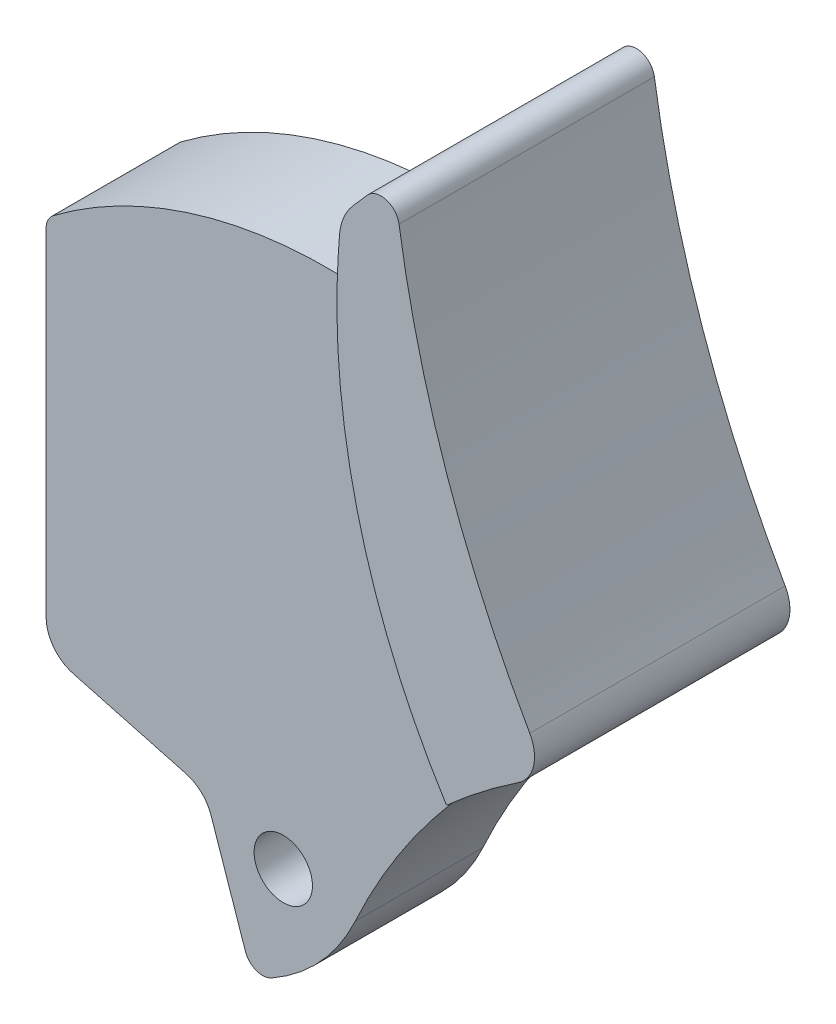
ISO-10303-21;
HEADER;
FILE_DESCRIPTION(('STEP AP214'),'2;1');
FILE_NAME('part.step','',(''),(''),'','','');
FILE_SCHEMA(('AUTOMOTIVE_DESIGN { 1 0 10303 214 1 1 1 1 }'));
ENDSEC;
DATA;
#1=APPLICATION_CONTEXT('core data for automotive mechanical design processes');
#2=APPLICATION_PROTOCOL_DEFINITION('international standard','automotive_design',2000,#1);
#3=PRODUCT_CONTEXT('',#1,'mechanical');
#4=PRODUCT('Part','Part','',(#3));
#5=PRODUCT_RELATED_PRODUCT_CATEGORY('part','',(#4));
#6=PRODUCT_DEFINITION_FORMATION('','',#4);
#7=PRODUCT_DEFINITION_CONTEXT('part definition',#1,'design');
#8=PRODUCT_DEFINITION('design','',#6,#7);
#9=PRODUCT_DEFINITION_SHAPE('','',#8);
#10=(LENGTH_UNIT() NAMED_UNIT(*) SI_UNIT(.MILLI.,.METRE.));
#11=(NAMED_UNIT(*) PLANE_ANGLE_UNIT() SI_UNIT($,.RADIAN.));
#12=(NAMED_UNIT(*) SI_UNIT($,.STERADIAN.) SOLID_ANGLE_UNIT());
#13=UNCERTAINTY_MEASURE_WITH_UNIT(LENGTH_MEASURE(1.E-05),#10,'distance_accuracy_value','');
#14=(GEOMETRIC_REPRESENTATION_CONTEXT(3) GLOBAL_UNCERTAINTY_ASSIGNED_CONTEXT((#13)) GLOBAL_UNIT_ASSIGNED_CONTEXT((#10,
#11,#12)) REPRESENTATION_CONTEXT('',''));
#15=CARTESIAN_POINT('',(0.,0.,0.));
#16=DIRECTION('',(0.,0.,1.));
#17=DIRECTION('',(1.,0.,0.));
#18=AXIS2_PLACEMENT_3D('',#15,#16,#17);
#19=CARTESIAN_POINT('',(14.3895907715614,1.74499070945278,14.));
#20=DIRECTION('',(0.,0.,-1.));
#21=DIRECTION('',(-1.,0.,0.));
#22=AXIS2_PLACEMENT_3D('',#19,#20,#21);
#23=CYLINDRICAL_SURFACE('',#22,25.);
#24=DIRECTION('',(0.,0.,-1.));
#25=VECTOR('',#24,1.);
#26=CARTESIAN_POINT('',(16.2535987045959,26.6754033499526,14.));
#27=LINE('',#26,#25);
#28=CARTESIAN_POINT('',(16.2535987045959,26.6754033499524,10.5));
#29=VERTEX_POINT('',#28);
#30=CARTESIAN_POINT('',(16.2535987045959,26.6754033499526,3.5));
#31=VERTEX_POINT('',#30);
#32=EDGE_CURVE('E547',#29,#31,#27,.T.);
#33=ORIENTED_EDGE('',*,*,#32,.T.);
#34=CARTESIAN_POINT('',(14.3895907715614,1.74499070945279,3.50000000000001));
#35=DIRECTION('',(0.,0.,1.));
#36=DIRECTION('',(1.,0.,0.));
#37=AXIS2_PLACEMENT_3D('',#34,#35,#36);
#38=CIRCLE('',#37,25.);
#39=CARTESIAN_POINT('',(-0.645696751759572,21.7184763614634,3.5));
#40=VERTEX_POINT('',#39);
#41=EDGE_CURVE('E654',#31,#40,#38,.T.);
#42=ORIENTED_EDGE('',*,*,#41,.T.);
#43=DIRECTION('',(0.,0.,-1.));
#44=VECTOR('',#43,1.);
#45=CARTESIAN_POINT('',(-0.645696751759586,21.7184763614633,14.));
#46=LINE('',#45,#44);
#47=CARTESIAN_POINT('',(-0.645696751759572,21.7184763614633,10.5));
#48=VERTEX_POINT('',#47);
#49=EDGE_CURVE('E544',#48,#40,#46,.T.);
#50=ORIENTED_EDGE('',*,*,#49,.F.);
#51=CARTESIAN_POINT('',(14.3895907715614,1.74499070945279,10.5));
#52=DIRECTION('',(0.,0.,1.));
#53=DIRECTION('',(1.,0.,0.));
#54=AXIS2_PLACEMENT_3D('',#51,#52,#53);
#55=CIRCLE('',#54,25.);
#56=EDGE_CURVE('E622',#29,#48,#55,.T.);
#57=ORIENTED_EDGE('',*,*,#56,.F.);
#58=EDGE_LOOP('',(#33,#42,#50,#57));
#59=FACE_BOUND('',#58,.T.);
#60=ADVANCED_FACE('F350',(#59),#23,.T.);
#61=CARTESIAN_POINT('',(-0.0442852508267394,20.9195369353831,14.));
#62=DIRECTION('',(0.,0.,-1.));
#63=DIRECTION('',(-1.,0.,0.));
#64=AXIS2_PLACEMENT_3D('',#61,#62,#63);
#65=CYLINDRICAL_SURFACE('',#64,1.);
#66=ORIENTED_EDGE('',*,*,#49,.T.);
#67=CARTESIAN_POINT('',(-0.0442852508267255,20.919536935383,3.5));
#68=DIRECTION('',(0.,0.,1.));
#69=DIRECTION('',(1.,0.,0.));
#70=AXIS2_PLACEMENT_3D('',#67,#68,#69);
#71=CIRCLE('',#70,1.);
#72=CARTESIAN_POINT('',(-1.04428525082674,20.9195369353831,3.49999999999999));
#73=VERTEX_POINT('',#72);
#74=EDGE_CURVE('E657',#40,#73,#71,.T.);
#75=ORIENTED_EDGE('',*,*,#74,.T.);
#76=DIRECTION('',(0.,0.,-1.));
#77=VECTOR('',#76,1.);
#78=CARTESIAN_POINT('',(-1.04428525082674,20.9195369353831,14.));
#79=LINE('',#78,#77);
#80=CARTESIAN_POINT('',(-1.04428525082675,20.9195369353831,10.5));
#81=VERTEX_POINT('',#80);
#82=EDGE_CURVE('E541',#81,#73,#79,.T.);
#83=ORIENTED_EDGE('',*,*,#82,.F.);
#84=CARTESIAN_POINT('',(-0.0442852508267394,20.919536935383,10.5));
#85=DIRECTION('',(0.,0.,1.));
#86=DIRECTION('',(1.,0.,0.));
#87=AXIS2_PLACEMENT_3D('',#84,#85,#86);
#88=CIRCLE('',#87,1.);
#89=EDGE_CURVE('E627',#48,#81,#88,.T.);
#90=ORIENTED_EDGE('',*,*,#89,.F.);
#91=EDGE_LOOP('',(#66,#75,#83,#90));
#92=FACE_BOUND('',#91,.T.);
#93=ADVANCED_FACE('F699',(#92),#65,.T.);
#94=CARTESIAN_POINT('',(-1.04428525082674,2.4467611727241,14.));
#95=DIRECTION('',(1.,0.,0.));
#96=DIRECTION('',(0.,1.,0.));
#97=AXIS2_PLACEMENT_3D('',#94,#95,#96);
#98=PLANE('',#97);
#99=ORIENTED_EDGE('',*,*,#82,.T.);
#100=DIRECTION('',(0.,-1.,0.));
#101=VECTOR('',#100,1.);
#102=CARTESIAN_POINT('',(-1.04428525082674,2.44676117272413,3.50000000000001));
#103=LINE('',#102,#101);
#104=CARTESIAN_POINT('',(-1.04428525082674,2.44676117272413,3.50000000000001));
#105=VERTEX_POINT('',#104);
#106=EDGE_CURVE('E660',#73,#105,#103,.T.);
#107=ORIENTED_EDGE('',*,*,#106,.T.);
#108=DIRECTION('',(0.,0.,-1.));
#109=VECTOR('',#108,1.);
#110=CARTESIAN_POINT('',(-1.04428525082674,2.4467611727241,14.));
#111=LINE('',#110,#109);
#112=CARTESIAN_POINT('',(-1.04428525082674,2.4467611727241,10.5));
#113=VERTEX_POINT('',#112);
#114=EDGE_CURVE('E538',#113,#105,#111,.T.);
#115=ORIENTED_EDGE('',*,*,#114,.F.);
#116=DIRECTION('',(0.,-1.,0.));
#117=VECTOR('',#116,1.);
#118=CARTESIAN_POINT('',(-1.04428525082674,2.4467611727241,10.5));
#119=LINE('',#118,#117);
#120=EDGE_CURVE('E629',#81,#113,#119,.T.);
#121=ORIENTED_EDGE('',*,*,#120,.F.);
#122=EDGE_LOOP('',(#99,#107,#115,#121));
#123=FACE_BOUND('',#122,.T.);
#124=ADVANCED_FACE('F706',(#123),#98,.F.);
#125=CARTESIAN_POINT('',(0.955714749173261,2.44676117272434,14.));
#126=DIRECTION('',(0.,0.,-1.));
#127=DIRECTION('',(-1.,0.,0.));
#128=AXIS2_PLACEMENT_3D('',#125,#126,#127);
#129=CYLINDRICAL_SURFACE('',#128,2.);
#130=ORIENTED_EDGE('',*,*,#114,.T.);
#131=CARTESIAN_POINT('',(0.955714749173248,2.44676117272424,3.5));
#132=DIRECTION('',(0.,0.,1.));
#133=DIRECTION('',(1.,0.,0.));
#134=AXIS2_PLACEMENT_3D('',#131,#132,#133);
#135=CIRCLE('',#134,2.);
#136=CARTESIAN_POINT('',(0.438076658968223,0.514909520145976,3.5));
#137=VERTEX_POINT('',#136);
#138=EDGE_CURVE('E663',#105,#137,#135,.T.);
#139=ORIENTED_EDGE('',*,*,#138,.T.);
#140=DIRECTION('',(0.,0.,-1.));
#141=VECTOR('',#140,1.);
#142=CARTESIAN_POINT('',(0.438076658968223,0.514909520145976,14.));
#143=LINE('',#142,#141);
#144=CARTESIAN_POINT('',(0.438076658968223,0.514909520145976,10.5));
#145=VERTEX_POINT('',#144);
#146=EDGE_CURVE('E535',#145,#137,#143,.T.);
#147=ORIENTED_EDGE('',*,*,#146,.F.);
#148=CARTESIAN_POINT('',(0.955714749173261,2.44676117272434,10.5));
#149=DIRECTION('',(0.,0.,1.));
#150=DIRECTION('',(1.,0.,0.));
#151=AXIS2_PLACEMENT_3D('',#148,#149,#150);
#152=CIRCLE('',#151,2.);
#153=EDGE_CURVE('E633',#113,#145,#152,.T.);
#154=ORIENTED_EDGE('',*,*,#153,.F.);
#155=EDGE_LOOP('',(#130,#139,#147,#154));
#156=FACE_BOUND('',#155,.T.);
#157=ADVANCED_FACE('F741',(#156),#129,.T.);
#158=CARTESIAN_POINT('',(0.438076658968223,0.514909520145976,14.));
#159=DIRECTION('',(0.258819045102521,0.96592582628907,0.));
#160=DIRECTION('',(-0.96592582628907,0.258819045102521,0.));
#161=AXIS2_PLACEMENT_3D('',#158,#159,#160);
#162=PLANE('',#161);
#163=ORIENTED_EDGE('',*,*,#146,.T.);
#164=DIRECTION('',(0.96592582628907,-0.258819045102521,0.));
#165=VECTOR('',#164,1.);
#166=CARTESIAN_POINT('',(0.438076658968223,0.514909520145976,3.5));
#167=LINE('',#166,#165);
#168=CARTESIAN_POINT('',(6.61894554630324,-1.14124930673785,3.5));
#169=VERTEX_POINT('',#168);
#170=EDGE_CURVE('E666',#137,#169,#167,.T.);
#171=ORIENTED_EDGE('',*,*,#170,.T.);
#172=DIRECTION('',(0.,0.,-1.));
#173=VECTOR('',#172,1.);
#174=CARTESIAN_POINT('',(6.61894554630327,-1.1412493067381,14.));
#175=LINE('',#174,#173);
#176=CARTESIAN_POINT('',(6.61894554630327,-1.14124930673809,10.5));
#177=VERTEX_POINT('',#176);
#178=EDGE_CURVE('E532',#177,#169,#175,.T.);
#179=ORIENTED_EDGE('',*,*,#178,.F.);
#180=DIRECTION('',(0.96592582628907,-0.258819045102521,0.));
#181=VECTOR('',#180,1.);
#182=CARTESIAN_POINT('',(0.438076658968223,0.514909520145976,10.5));
#183=LINE('',#182,#181);
#184=EDGE_CURVE('E635',#145,#177,#183,.T.);
#185=ORIENTED_EDGE('',*,*,#184,.F.);
#186=EDGE_LOOP('',(#163,#171,#179,#185));
#187=FACE_BOUND('',#186,.T.);
#188=ADVANCED_FACE('F747',(#187),#162,.F.);
#189=CARTESIAN_POINT('',(6.10130745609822,-3.07310095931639,14.));
#190=DIRECTION('',(0.,0.,-1.));
#191=DIRECTION('',(-1.,0.,0.));
#192=AXIS2_PLACEMENT_3D('',#189,#190,#191);
#193=CYLINDRICAL_SURFACE('',#192,2.);
#194=ORIENTED_EDGE('',*,*,#178,.T.);
#195=CARTESIAN_POINT('',(6.1013074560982,-3.07310095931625,3.50000000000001));
#196=DIRECTION('',(0.,0.,1.));
#197=DIRECTION('',(1.,0.,0.));
#198=AXIS2_PLACEMENT_3D('',#195,#196,#197);
#199=CIRCLE('',#198,2.);
#200=CARTESIAN_POINT('',(7.9938718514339,-2.42641710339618,3.5));
#201=VERTEX_POINT('',#200);
#202=EDGE_CURVE('E669',#169,#201,#199,.F.);
#203=ORIENTED_EDGE('',*,*,#202,.T.);
#204=DIRECTION('',(0.,0.,-1.));
#205=VECTOR('',#204,1.);
#206=CARTESIAN_POINT('',(7.9938718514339,-2.42641710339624,14.));
#207=LINE('',#206,#205);
#208=CARTESIAN_POINT('',(7.9938718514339,-2.42641710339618,10.5));
#209=VERTEX_POINT('',#208);
#210=EDGE_CURVE('E529',#209,#201,#207,.T.);
#211=ORIENTED_EDGE('',*,*,#210,.F.);
#212=CARTESIAN_POINT('',(6.10130745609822,-3.0731009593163,10.5));
#213=DIRECTION('',(0.,0.,1.));
#214=DIRECTION('',(1.,0.,0.));
#215=AXIS2_PLACEMENT_3D('',#212,#213,#214);
#216=CIRCLE('',#215,2.);
#217=EDGE_CURVE('E637',#177,#209,#216,.F.);
#218=ORIENTED_EDGE('',*,*,#217,.F.);
#219=EDGE_LOOP('',(#194,#203,#211,#218));
#220=FACE_BOUND('',#219,.T.);
#221=ADVANCED_FACE('F749',(#220),#193,.F.);
#222=CARTESIAN_POINT('',(7.9938718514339,-2.42641710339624,14.));
#223=DIRECTION('',(0.946282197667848,0.323341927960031,0.));
#224=DIRECTION('',(-0.323341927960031,0.946282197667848,0.));
#225=AXIS2_PLACEMENT_3D('',#222,#223,#224);
#226=PLANE('',#225);
#227=ORIENTED_EDGE('',*,*,#210,.T.);
#228=DIRECTION('',(0.323341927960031,-0.946282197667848,0.));
#229=VECTOR('',#228,1.);
#230=CARTESIAN_POINT('',(7.9938718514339,-2.42641710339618,3.5));
#231=LINE('',#230,#229);
#232=CARTESIAN_POINT('',(9.88088302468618,-7.94888395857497,3.5));
#233=VERTEX_POINT('',#232);
#234=EDGE_CURVE('E672',#201,#233,#231,.T.);
#235=ORIENTED_EDGE('',*,*,#234,.T.);
#236=DIRECTION('',(0.,0.,-1.));
#237=VECTOR('',#236,1.);
#238=CARTESIAN_POINT('',(9.88088302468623,-7.94888395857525,14.));
#239=LINE('',#238,#237);
#240=CARTESIAN_POINT('',(9.88088302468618,-7.94888395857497,10.5));
#241=VERTEX_POINT('',#240);
#242=EDGE_CURVE('E520',#241,#233,#239,.T.);
#243=ORIENTED_EDGE('',*,*,#242,.F.);
#244=DIRECTION('',(0.323341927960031,-0.946282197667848,0.));
#245=VECTOR('',#244,1.);
#246=CARTESIAN_POINT('',(7.9938718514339,-2.42641710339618,10.5));
#247=LINE('',#246,#245);
#248=EDGE_CURVE('E639',#209,#241,#247,.T.);
#249=ORIENTED_EDGE('',*,*,#248,.F.);
#250=EDGE_LOOP('',(#227,#235,#243,#249));
#251=FACE_BOUND('',#250,.T.);
#252=ADVANCED_FACE('F755',(#251),#226,.F.);
#253=CARTESIAN_POINT('',(10.827165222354,-7.62554203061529,14.));
#254=DIRECTION('',(0.,0.,-1.));
#255=DIRECTION('',(-1.,0.,0.));
#256=AXIS2_PLACEMENT_3D('',#253,#254,#255);
#257=CYLINDRICAL_SURFACE('',#256,1.);
#258=ORIENTED_EDGE('',*,*,#242,.T.);
#259=CARTESIAN_POINT('',(10.8271652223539,-7.62554203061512,3.5));
#260=DIRECTION('',(0.,0.,1.));
#261=DIRECTION('',(1.,0.,0.));
#262=AXIS2_PLACEMENT_3D('',#259,#260,#261);
#263=CIRCLE('',#262,1.);
#264=CARTESIAN_POINT('',(11.3196646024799,-8.4958548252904,3.5));
#265=VERTEX_POINT('',#264);
#266=EDGE_CURVE('E675',#233,#265,#263,.T.);
#267=ORIENTED_EDGE('',*,*,#266,.T.);
#268=DIRECTION('',(0.,0.,-1.));
#269=VECTOR('',#268,1.);
#270=CARTESIAN_POINT('',(11.3196646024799,-8.49585482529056,14.));
#271=LINE('',#270,#269);
#272=CARTESIAN_POINT('',(11.3196646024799,-8.49585482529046,10.5));
#273=VERTEX_POINT('',#272);
#274=EDGE_CURVE('E516',#273,#265,#271,.T.);
#275=ORIENTED_EDGE('',*,*,#274,.F.);
#276=CARTESIAN_POINT('',(10.8271652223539,-7.6255420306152,10.5));
#277=DIRECTION('',(0.,0.,1.));
#278=DIRECTION('',(1.,0.,0.));
#279=AXIS2_PLACEMENT_3D('',#276,#277,#278);
#280=CIRCLE('',#279,1.);
#281=EDGE_CURVE('E641',#241,#273,#280,.T.);
#282=ORIENTED_EDGE('',*,*,#281,.F.);
#283=EDGE_LOOP('',(#258,#267,#275,#282));
#284=FACE_BOUND('',#283,.T.);
#285=ADVANCED_FACE('F757',(#284),#257,.T.);
#286=CARTESIAN_POINT('',(5.902171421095,1.07758591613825,14.));
#287=DIRECTION('',(0.,0.,-1.));
#288=DIRECTION('',(-1.,0.,0.));
#289=AXIS2_PLACEMENT_3D('',#286,#287,#288);
#290=CYLINDRICAL_SURFACE('',#289,11.);
#291=ORIENTED_EDGE('',*,*,#274,.T.);
#292=CARTESIAN_POINT('',(5.902171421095,1.07758591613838,3.5));
#293=DIRECTION('',(0.,0.,1.));
#294=DIRECTION('',(1.,0.,0.));
#295=AXIS2_PLACEMENT_3D('',#292,#293,#294);
#296=CIRCLE('',#295,11.);
#297=CARTESIAN_POINT('',(15.8992918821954,-3.51126824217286,3.5));
#298=VERTEX_POINT('',#297);
#299=EDGE_CURVE('E678',#265,#298,#296,.T.);
#300=ORIENTED_EDGE('',*,*,#299,.T.);
#301=DIRECTION('',(0.,0.,-1.));
#302=VECTOR('',#301,1.);
#303=CARTESIAN_POINT('',(15.8992918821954,-3.51126824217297,14.));
#304=LINE('',#303,#302);
#305=CARTESIAN_POINT('',(15.8992918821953,-3.51126824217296,10.5));
#306=VERTEX_POINT('',#305);
#307=EDGE_CURVE('E513',#306,#298,#304,.T.);
#308=ORIENTED_EDGE('',*,*,#307,.F.);
#309=CARTESIAN_POINT('',(5.902171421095,1.07758591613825,10.5));
#310=DIRECTION('',(0.,0.,1.));
#311=DIRECTION('',(1.,0.,0.));
#312=AXIS2_PLACEMENT_3D('',#309,#310,#311);
#313=CIRCLE('',#312,11.);
#314=EDGE_CURVE('E643',#273,#306,#313,.T.);
#315=ORIENTED_EDGE('',*,*,#314,.F.);
#316=EDGE_LOOP('',(#291,#300,#308,#315));
#317=FACE_BOUND('',#316,.T.);
#318=ADVANCED_FACE('F720',(#317),#290,.T.);
#319=CARTESIAN_POINT('',(21.5293611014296,31.9119027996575,14.));
#320=DIRECTION('',(0.,0.,-1.));
#321=DIRECTION('',(-1.,0.,0.));
#322=AXIS2_PLACEMENT_3D('',#319,#320,#321);
#323=CYLINDRICAL_SURFACE('',#322,3.);
#324=CARTESIAN_POINT('',(21.5293611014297,31.9119027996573,0.));
#325=DIRECTION('',(0.,0.,1.));
#326=DIRECTION('',(-1.,0.,0.));
#327=AXIS2_PLACEMENT_3D('',#324,#325,#326);
#328=CIRCLE('',#327,3.);
#329=CARTESIAN_POINT('',(19.2698708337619,33.8854031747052,0.));
#330=VERTEX_POINT('',#329);
#331=CARTESIAN_POINT('',(18.5399629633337,32.1638924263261,0.));
#332=VERTEX_POINT('',#331);
#333=EDGE_CURVE('E614',#330,#332,#328,.T.);
#334=ORIENTED_EDGE('',*,*,#333,.T.);
#335=DIRECTION('',(0.,0.,-1.));
#336=VECTOR('',#335,1.);
#337=CARTESIAN_POINT('',(18.5399629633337,32.1638924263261,14.));
#338=LINE('',#337,#336);
#339=CARTESIAN_POINT('',(18.5399629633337,32.1638924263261,14.));
#340=VERTEX_POINT('',#339);
#341=EDGE_CURVE('E553',#340,#332,#338,.T.);
#342=ORIENTED_EDGE('',*,*,#341,.F.);
#343=CARTESIAN_POINT('',(21.5293611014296,31.9119027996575,14.));
#344=DIRECTION('',(0.,0.,1.));
#345=DIRECTION('',(-1.,0.,0.));
#346=AXIS2_PLACEMENT_3D('',#343,#344,#345);
#347=CIRCLE('',#346,3.);
#348=CARTESIAN_POINT('',(19.2698708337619,33.8854031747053,14.));
#349=VERTEX_POINT('',#348);
#350=EDGE_CURVE('E557',#349,#340,#347,.T.);
#351=ORIENTED_EDGE('',*,*,#350,.F.);
#352=DIRECTION('',(0.,0.,-1.));
#353=VECTOR('',#352,1.);
#354=CARTESIAN_POINT('',(19.2698708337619,33.8854031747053,14.));
#355=LINE('',#354,#353);
#356=EDGE_CURVE('E579',#349,#330,#355,.T.);
#357=ORIENTED_EDGE('',*,*,#356,.T.);
#358=EDGE_LOOP('',(#334,#342,#351,#357));
#359=FACE_BOUND('',#358,.T.);
#360=ADVANCED_FACE('F352',(#359),#323,.T.);
#361=CARTESIAN_POINT('',(57.4021387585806,28.8880272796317,14.));
#362=DIRECTION('',(0.,0.,-1.));
#363=DIRECTION('',(-1.,0.,0.));
#364=AXIS2_PLACEMENT_3D('',#361,#362,#363);
#365=CYLINDRICAL_SURFACE('',#364,39.);
#366=CARTESIAN_POINT('',(57.4021387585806,28.8880272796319,0.));
#367=DIRECTION('',(0.,0.,1.));
#368=DIRECTION('',(1.,0.,0.));
#369=AXIS2_PLACEMENT_3D('',#366,#367,#368);
#370=CIRCLE('',#369,39.);
#371=CARTESIAN_POINT('',(18.402691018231,28.6804798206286,0.));
#372=VERTEX_POINT('',#371);
#373=EDGE_CURVE('E612',#332,#372,#370,.T.);
#374=ORIENTED_EDGE('',*,*,#373,.T.);
#375=DIRECTION('',(0.,0.,-1.));
#376=VECTOR('',#375,1.);
#377=CARTESIAN_POINT('',(18.402691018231,28.6804798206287,14.));
#378=LINE('',#377,#376);
#379=CARTESIAN_POINT('',(18.402691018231,28.6804798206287,14.));
#380=VERTEX_POINT('',#379);
#381=EDGE_CURVE('E550',#380,#372,#378,.T.);
#382=ORIENTED_EDGE('',*,*,#381,.F.);
#383=CARTESIAN_POINT('',(57.4021387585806,28.8880272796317,14.));
#384=DIRECTION('',(0.,0.,1.));
#385=DIRECTION('',(1.,0.,0.));
#386=AXIS2_PLACEMENT_3D('',#383,#384,#385);
#387=CIRCLE('',#386,39.);
#388=EDGE_CURVE('E559',#340,#380,#387,.T.);
#389=ORIENTED_EDGE('',*,*,#388,.F.);
#390=ORIENTED_EDGE('',*,*,#341,.T.);
#391=EDGE_LOOP('',(#374,#382,#389,#390));
#392=FACE_BOUND('',#391,.T.);
#393=ADVANCED_FACE('F713',(#392),#365,.T.);
#394=CARTESIAN_POINT('',(16.4027193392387,28.6698363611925,14.));
#395=DIRECTION('',(0.,0.,-1.));
#396=DIRECTION('',(-1.,0.,0.));
#397=AXIS2_PLACEMENT_3D('',#394,#395,#396);
#398=CYLINDRICAL_SURFACE('',#397,2.);
#399=CARTESIAN_POINT('',(16.4027193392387,28.6698363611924,0.));
#400=DIRECTION('',(0.,0.,-1.));
#401=DIRECTION('',(-1.,0.,0.));
#402=AXIS2_PLACEMENT_3D('',#399,#400,#401);
#403=CIRCLE('',#402,2.);
#404=CARTESIAN_POINT('',(18.395274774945,28.4974332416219,0.));
#405=VERTEX_POINT('',#404);
#406=EDGE_CURVE('E609',#372,#405,#403,.T.);
#407=ORIENTED_EDGE('',*,*,#406,.T.);
#408=DIRECTION('',(0.,0.,1.));
#409=VECTOR('',#408,1.);
#410=CARTESIAN_POINT('',(18.395274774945,28.4974332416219,1.75));
#411=LINE('',#410,#409);
#412=CARTESIAN_POINT('',(18.3952747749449,28.4974332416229,3.5));
#413=VERTEX_POINT('',#412);
#414=EDGE_CURVE('E367',#405,#413,#411,.T.);
#415=ORIENTED_EDGE('',*,*,#414,.T.);
#416=CARTESIAN_POINT('',(16.4027193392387,28.6698363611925,3.5));
#417=DIRECTION('',(0.,0.,1.));
#418=DIRECTION('',(1.,0.,0.));
#419=AXIS2_PLACEMENT_3D('',#416,#417,#418);
#420=CIRCLE('',#419,2.);
#421=EDGE_CURVE('E507',#413,#31,#420,.F.);
#422=ORIENTED_EDGE('',*,*,#421,.T.);
#423=ORIENTED_EDGE('',*,*,#32,.F.);
#424=CARTESIAN_POINT('',(16.4027193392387,28.6698363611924,10.5));
#425=DIRECTION('',(0.,0.,1.));
#426=DIRECTION('',(1.,0.,0.));
#427=AXIS2_PLACEMENT_3D('',#424,#425,#426);
#428=CIRCLE('',#427,2.);
#429=CARTESIAN_POINT('',(18.3952747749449,28.4974332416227,10.5));
#430=VERTEX_POINT('',#429);
#431=EDGE_CURVE('E617',#430,#29,#428,.F.);
#432=ORIENTED_EDGE('',*,*,#431,.F.);
#433=DIRECTION('',(0.,0.,1.));
#434=VECTOR('',#433,1.);
#435=CARTESIAN_POINT('',(18.395274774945,28.4974332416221,12.25));
#436=LINE('',#435,#434);
#437=CARTESIAN_POINT('',(18.395274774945,28.4974332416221,14.));
#438=VERTEX_POINT('',#437);
#439=EDGE_CURVE('E645',#430,#438,#436,.T.);
#440=ORIENTED_EDGE('',*,*,#439,.T.);
#441=CARTESIAN_POINT('',(16.4027193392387,28.6698363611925,14.));
#442=DIRECTION('',(0.,0.,-1.));
#443=DIRECTION('',(-1.,0.,0.));
#444=AXIS2_PLACEMENT_3D('',#441,#442,#443);
#445=CIRCLE('',#444,2.);
#446=EDGE_CURVE('E566',#380,#438,#445,.T.);
#447=ORIENTED_EDGE('',*,*,#446,.F.);
#448=ORIENTED_EDGE('',*,*,#381,.T.);
#449=EDGE_LOOP('',(#407,#415,#422,#423,#432,#440,#447,#448));
#450=FACE_BOUND('',#449,.T.);
#451=ADVANCED_FACE('F711',(#450),#398,.F.);
#452=CARTESIAN_POINT('',(47.7083115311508,-18.1121678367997,14.));
#453=DIRECTION('',(0.,0.,-1.));
#454=DIRECTION('',(-1.,0.,0.));
#455=AXIS2_PLACEMENT_3D('',#452,#453,#454);
#456=CYLINDRICAL_SURFACE('',#455,35.);
#457=CARTESIAN_POINT('',(47.7083115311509,-18.1121678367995,3.5));
#458=DIRECTION('',(0.,0.,1.));
#459=DIRECTION('',(1.,0.,0.));
#460=AXIS2_PLACEMENT_3D('',#457,#458,#459);
#461=CIRCLE('',#460,35.);
#462=CARTESIAN_POINT('',(24.4011950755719,7.99871729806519,3.50000000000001));
#463=VERTEX_POINT('',#462);
#464=EDGE_CURVE('E11',#298,#463,#461,.F.);
#465=ORIENTED_EDGE('',*,*,#464,.T.);
#466=DIRECTION('',(0.,0.,1.));
#467=VECTOR('',#466,1.);
#468=CARTESIAN_POINT('',(24.4011950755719,7.99871729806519,1.75));
#469=LINE('',#468,#467);
#470=CARTESIAN_POINT('',(24.4011950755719,7.99871729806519,0.));
#471=VERTEX_POINT('',#470);
#472=EDGE_CURVE('E495',#463,#471,#469,.F.);
#473=ORIENTED_EDGE('',*,*,#472,.T.);
#474=CARTESIAN_POINT('',(47.7083115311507,-18.1121678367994,0.));
#475=DIRECTION('',(0.,0.,-1.));
#476=DIRECTION('',(1.,0.,0.));
#477=AXIS2_PLACEMENT_3D('',#474,#475,#476);
#478=CIRCLE('',#477,35.);
#479=CARTESIAN_POINT('',(28.3382848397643,11.0391968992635,0.));
#480=VERTEX_POINT('',#479);
#481=EDGE_CURVE('E605',#471,#480,#478,.T.);
#482=ORIENTED_EDGE('',*,*,#481,.T.);
#483=DIRECTION('',(0.,0.,-1.));
#484=VECTOR('',#483,1.);
#485=CARTESIAN_POINT('',(28.3382848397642,11.0391968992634,14.));
#486=LINE('',#485,#484);
#487=CARTESIAN_POINT('',(28.3382848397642,11.0391968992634,14.));
#488=VERTEX_POINT('',#487);
#489=EDGE_CURVE('E517',#488,#480,#486,.T.);
#490=ORIENTED_EDGE('',*,*,#489,.F.);
#491=CARTESIAN_POINT('',(47.7083115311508,-18.1121678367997,14.));
#492=DIRECTION('',(0.,0.,-1.));
#493=DIRECTION('',(1.,0.,0.));
#494=AXIS2_PLACEMENT_3D('',#491,#492,#493);
#495=CIRCLE('',#494,35.);
#496=CARTESIAN_POINT('',(24.4011950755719,7.99871729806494,14.));
#497=VERTEX_POINT('',#496);
#498=EDGE_CURVE('E569',#497,#488,#495,.T.);
#499=ORIENTED_EDGE('',*,*,#498,.F.);
#500=DIRECTION('',(0.,0.,1.));
#501=VECTOR('',#500,1.);
#502=CARTESIAN_POINT('',(24.4011950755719,7.99871729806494,12.25));
#503=LINE('',#502,#501);
#504=CARTESIAN_POINT('',(24.401195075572,7.99871729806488,10.5));
#505=VERTEX_POINT('',#504);
#506=EDGE_CURVE('E375',#497,#505,#503,.F.);
#507=ORIENTED_EDGE('',*,*,#506,.T.);
#508=CARTESIAN_POINT('',(47.7083115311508,-18.1121678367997,10.5));
#509=DIRECTION('',(0.,0.,1.));
#510=DIRECTION('',(1.,0.,0.));
#511=AXIS2_PLACEMENT_3D('',#508,#509,#510);
#512=CIRCLE('',#511,35.);
#513=EDGE_CURVE('E359',#306,#505,#512,.F.);
#514=ORIENTED_EDGE('',*,*,#513,.F.);
#515=ORIENTED_EDGE('',*,*,#307,.T.);
#516=EDGE_LOOP('',(#465,#473,#482,#490,#499,#507,#514,#515));
#517=FACE_BOUND('',#516,.T.);
#518=ADVANCED_FACE('F510',(#517),#456,.F.);
#519=CARTESIAN_POINT('',(27.231426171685,12.7049891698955,14.));
#520=DIRECTION('',(0.,0.,-1.));
#521=DIRECTION('',(-1.,0.,0.));
#522=AXIS2_PLACEMENT_3D('',#519,#520,#521);
#523=CYLINDRICAL_SURFACE('',#522,2.);
#524=CARTESIAN_POINT('',(27.2314261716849,12.7049891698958,0.));
#525=DIRECTION('',(0.,0.,1.));
#526=DIRECTION('',(-1.,0.,0.));
#527=AXIS2_PLACEMENT_3D('',#524,#525,#526);
#528=CIRCLE('',#527,2.);
#529=CARTESIAN_POINT('',(28.9693051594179,13.6948258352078,0.));
#530=VERTEX_POINT('',#529);
#531=EDGE_CURVE('E601',#480,#530,#528,.T.);
#532=ORIENTED_EDGE('',*,*,#531,.T.);
#533=DIRECTION('',(0.,0.,-1.));
#534=VECTOR('',#533,1.);
#535=CARTESIAN_POINT('',(28.9693051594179,13.6948258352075,14.));
#536=LINE('',#535,#534);
#537=CARTESIAN_POINT('',(28.9693051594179,13.6948258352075,14.));
#538=VERTEX_POINT('',#537);
#539=EDGE_CURVE('E523',#538,#530,#536,.T.);
#540=ORIENTED_EDGE('',*,*,#539,.F.);
#541=CARTESIAN_POINT('',(27.231426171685,12.7049891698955,14.));
#542=DIRECTION('',(0.,0.,1.));
#543=DIRECTION('',(-1.,0.,0.));
#544=AXIS2_PLACEMENT_3D('',#541,#542,#543);
#545=CIRCLE('',#544,2.);
#546=EDGE_CURVE('E571',#488,#538,#545,.T.);
#547=ORIENTED_EDGE('',*,*,#546,.F.);
#548=ORIENTED_EDGE('',*,*,#489,.T.);
#549=EDGE_LOOP('',(#532,#540,#547,#548));
#550=FACE_BOUND('',#549,.T.);
#551=ADVANCED_FACE('F728',(#550),#523,.T.);
#552=CARTESIAN_POINT('',(81.1056747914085,43.3899257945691,14.));
#553=DIRECTION('',(0.,0.,-1.));
#554=DIRECTION('',(-1.,0.,0.));
#555=AXIS2_PLACEMENT_3D('',#552,#553,#554);
#556=CYLINDRICAL_SURFACE('',#555,60.);
#557=CARTESIAN_POINT('',(81.1056747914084,43.3899257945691,0.));
#558=DIRECTION('',(0.,0.,-1.));
#559=DIRECTION('',(-1.,0.,0.));
#560=AXIS2_PLACEMENT_3D('',#557,#558,#559);
#561=CIRCLE('',#560,60.);
#562=CARTESIAN_POINT('',(21.8008188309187,34.2831118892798,0.));
#563=VERTEX_POINT('',#562);
#564=EDGE_CURVE('E594',#530,#563,#561,.T.);
#565=ORIENTED_EDGE('',*,*,#564,.T.);
#566=DIRECTION('',(0.,0.,-1.));
#567=VECTOR('',#566,1.);
#568=CARTESIAN_POINT('',(21.8008188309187,34.2831118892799,14.));
#569=LINE('',#568,#567);
#570=CARTESIAN_POINT('',(21.8008188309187,34.2831118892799,14.));
#571=VERTEX_POINT('',#570);
#572=EDGE_CURVE('E585',#571,#563,#569,.T.);
#573=ORIENTED_EDGE('',*,*,#572,.F.);
#574=CARTESIAN_POINT('',(81.1056747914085,43.3899257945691,14.));
#575=DIRECTION('',(0.,0.,-1.));
#576=DIRECTION('',(-1.,0.,0.));
#577=AXIS2_PLACEMENT_3D('',#574,#575,#576);
#578=CIRCLE('',#577,60.);
#579=EDGE_CURVE('E573',#538,#571,#578,.T.);
#580=ORIENTED_EDGE('',*,*,#579,.F.);
#581=ORIENTED_EDGE('',*,*,#539,.T.);
#582=EDGE_LOOP('',(#565,#573,#580,#581));
#583=FACE_BOUND('',#582,.T.);
#584=ADVANCED_FACE('F592',(#583),#556,.F.);
#585=CARTESIAN_POINT('',(20.8124045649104,34.1313316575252,14.));
#586=DIRECTION('',(0.,0.,-1.));
#587=DIRECTION('',(-1.,0.,0.));
#588=AXIS2_PLACEMENT_3D('',#585,#586,#587);
#589=CYLINDRICAL_SURFACE('',#588,1.);
#590=CARTESIAN_POINT('',(20.8124045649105,34.131331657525,0.));
#591=DIRECTION('',(0.,0.,1.));
#592=DIRECTION('',(-1.,0.,0.));
#593=AXIS2_PLACEMENT_3D('',#590,#591,#592);
#594=CIRCLE('',#593,1.);
#595=CARTESIAN_POINT('',(20.0592411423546,34.7891651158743,0.));
#596=VERTEX_POINT('',#595);
#597=EDGE_CURVE('E603',#563,#596,#594,.T.);
#598=ORIENTED_EDGE('',*,*,#597,.T.);
#599=DIRECTION('',(0.,0.,-1.));
#600=VECTOR('',#599,1.);
#601=CARTESIAN_POINT('',(20.0592411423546,34.7891651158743,14.));
#602=LINE('',#601,#600);
#603=CARTESIAN_POINT('',(20.0592411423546,34.7891651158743,14.));
#604=VERTEX_POINT('',#603);
#605=EDGE_CURVE('E582',#604,#596,#602,.T.);
#606=ORIENTED_EDGE('',*,*,#605,.F.);
#607=CARTESIAN_POINT('',(20.8124045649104,34.1313316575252,14.));
#608=DIRECTION('',(0.,0.,1.));
#609=DIRECTION('',(-1.,0.,0.));
#610=AXIS2_PLACEMENT_3D('',#607,#608,#609);
#611=CIRCLE('',#610,1.);
#612=EDGE_CURVE('E575',#571,#604,#611,.T.);
#613=ORIENTED_EDGE('',*,*,#612,.F.);
#614=ORIENTED_EDGE('',*,*,#572,.T.);
#615=EDGE_LOOP('',(#598,#606,#613,#614));
#616=FACE_BOUND('',#615,.T.);
#617=ADVANCED_FACE('F796',(#616),#589,.T.);
#618=CARTESIAN_POINT('',(20.0592411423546,34.7891651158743,14.));
#619=DIRECTION('',(0.753163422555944,-0.657833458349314,0.));
#620=DIRECTION('',(0.657833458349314,0.753163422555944,0.));
#621=AXIS2_PLACEMENT_3D('',#618,#619,#620);
#622=PLANE('',#621);
#623=DIRECTION('',(-0.657833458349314,-0.753163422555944,0.));
#624=VECTOR('',#623,1.);
#625=CARTESIAN_POINT('',(20.0592411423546,34.7891651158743,0.));
#626=LINE('',#625,#624);
#627=EDGE_CURVE('E560',#596,#330,#626,.T.);
#628=ORIENTED_EDGE('',*,*,#627,.T.);
#629=ORIENTED_EDGE('',*,*,#356,.F.);
#630=DIRECTION('',(-0.657833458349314,-0.753163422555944,0.));
#631=VECTOR('',#630,1.);
#632=CARTESIAN_POINT('',(20.0592411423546,34.7891651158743,14.));
#633=LINE('',#632,#631);
#634=EDGE_CURVE('E577',#604,#349,#633,.T.);
#635=ORIENTED_EDGE('',*,*,#634,.F.);
#636=ORIENTED_EDGE('',*,*,#605,.T.);
#637=EDGE_LOOP('',(#628,#629,#635,#636));
#638=FACE_BOUND('',#637,.T.);
#639=ADVANCED_FACE('F799',(#638),#622,.F.);
#640=CARTESIAN_POINT('',(21.5293611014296,31.9119027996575,14.));
#641=DIRECTION('',(0.,0.,-1.));
#642=DIRECTION('',(-1.,0.,0.));
#643=AXIS2_PLACEMENT_3D('',#640,#641,#642);
#644=PLANE('',#643);
#645=ORIENTED_EDGE('',*,*,#446,.T.);
#646=CARTESIAN_POINT('',(57.394143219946,28.7945191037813,14.));
#647=DIRECTION('',(0.,0.,-1.));
#648=DIRECTION('',(1.,0.,0.));
#649=AXIS2_PLACEMENT_3D('',#646,#647,#648);
#650=CIRCLE('',#649,39.);
#651=EDGE_CURVE('E651',#497,#438,#650,.T.);
#652=ORIENTED_EDGE('',*,*,#651,.F.);
#653=ORIENTED_EDGE('',*,*,#498,.T.);
#654=ORIENTED_EDGE('',*,*,#546,.T.);
#655=ORIENTED_EDGE('',*,*,#579,.T.);
#656=ORIENTED_EDGE('',*,*,#612,.T.);
#657=ORIENTED_EDGE('',*,*,#634,.T.);
#658=ORIENTED_EDGE('',*,*,#350,.T.);
#659=ORIENTED_EDGE('',*,*,#388,.T.);
#660=EDGE_LOOP('',(#645,#652,#653,#654,#655,#656,#657,#658,#659));
#661=FACE_BOUND('',#660,.T.);
#662=ADVANCED_FACE('F730',(#661),#644,.F.);
#663=CARTESIAN_POINT('',(21.5293611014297,31.9119027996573,0.));
#664=DIRECTION('',(0.,0.,-1.));
#665=DIRECTION('',(-1.,0.,0.));
#666=AXIS2_PLACEMENT_3D('',#663,#664,#665);
#667=PLANE('',#666);
#668=CARTESIAN_POINT('',(57.394143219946,28.7945191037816,0.));
#669=DIRECTION('',(0.,0.,-1.));
#670=DIRECTION('',(1.,0.,0.));
#671=AXIS2_PLACEMENT_3D('',#668,#669,#670);
#672=CIRCLE('',#671,39.);
#673=EDGE_CURVE('E499',#471,#405,#672,.T.);
#674=ORIENTED_EDGE('',*,*,#673,.T.);
#675=ORIENTED_EDGE('',*,*,#406,.F.);
#676=ORIENTED_EDGE('',*,*,#373,.F.);
#677=ORIENTED_EDGE('',*,*,#333,.F.);
#678=ORIENTED_EDGE('',*,*,#627,.F.);
#679=ORIENTED_EDGE('',*,*,#597,.F.);
#680=ORIENTED_EDGE('',*,*,#564,.F.);
#681=ORIENTED_EDGE('',*,*,#531,.F.);
#682=ORIENTED_EDGE('',*,*,#481,.F.);
#683=EDGE_LOOP('',(#674,#675,#676,#677,#678,#679,#680,#681,#682));
#684=FACE_BOUND('',#683,.T.);
#685=ADVANCED_FACE('F600',(#684),#667,.T.);
#686=CARTESIAN_POINT('',(57.394143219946,28.7945191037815,10.5));
#687=DIRECTION('',(0.,0.,1.));
#688=DIRECTION('',(1.,0.,0.));
#689=AXIS2_PLACEMENT_3D('',#686,#687,#688);
#690=PLANE('',#689);
#691=CARTESIAN_POINT('',(11.9557147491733,-3.,10.5));
#692=DIRECTION('',(0.,0.,1.));
#693=DIRECTION('',(1.,0.,0.));
#694=AXIS2_PLACEMENT_3D('',#691,#692,#693);
#695=CIRCLE('',#694,1.6);
#696=CARTESIAN_POINT('',(13.5557147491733,-3.,10.5));
#697=VERTEX_POINT('',#696);
#698=EDGE_CURVE('E682',#697,#697,#695,.T.);
#699=ORIENTED_EDGE('',*,*,#698,.F.);
#700=EDGE_LOOP('',(#699));
#701=FACE_BOUND('',#700,.T.);
#702=ORIENTED_EDGE('',*,*,#431,.T.);
#703=ORIENTED_EDGE('',*,*,#56,.T.);
#704=ORIENTED_EDGE('',*,*,#89,.T.);
#705=ORIENTED_EDGE('',*,*,#120,.T.);
#706=ORIENTED_EDGE('',*,*,#153,.T.);
#707=ORIENTED_EDGE('',*,*,#184,.T.);
#708=ORIENTED_EDGE('',*,*,#217,.T.);
#709=ORIENTED_EDGE('',*,*,#248,.T.);
#710=ORIENTED_EDGE('',*,*,#281,.T.);
#711=ORIENTED_EDGE('',*,*,#314,.T.);
#712=ORIENTED_EDGE('',*,*,#513,.T.);
#713=CARTESIAN_POINT('',(57.394143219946,28.7945191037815,10.5));
#714=DIRECTION('',(0.,0.,-1.));
#715=DIRECTION('',(1.,0.,0.));
#716=AXIS2_PLACEMENT_3D('',#713,#714,#715);
#717=CIRCLE('',#716,39.);
#718=EDGE_CURVE('E649',#505,#430,#717,.T.);
#719=ORIENTED_EDGE('',*,*,#718,.T.);
#720=EDGE_LOOP('',(#702,#703,#704,#705,#706,#707,#708,#709,#710,#711,#712,#719));
#721=FACE_BOUND('',#720,.T.);
#722=ADVANCED_FACE('F736',(#701,#721),#690,.T.);
#723=CARTESIAN_POINT('',(57.394143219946,28.7945191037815,10.5));
#724=DIRECTION('',(0.,0.,1.));
#725=DIRECTION('',(1.,0.,0.));
#726=AXIS2_PLACEMENT_3D('',#723,#724,#725);
#727=CYLINDRICAL_SURFACE('',#726,39.);
#728=ORIENTED_EDGE('',*,*,#718,.F.);
#729=ORIENTED_EDGE('',*,*,#506,.F.);
#730=ORIENTED_EDGE('',*,*,#651,.T.);
#731=ORIENTED_EDGE('',*,*,#439,.F.);
#732=EDGE_LOOP('',(#728,#729,#730,#731));
#733=FACE_BOUND('',#732,.T.);
#734=ADVANCED_FACE('F731',(#733),#727,.T.);
#735=CARTESIAN_POINT('',(57.394143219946,28.7945191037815,3.50000000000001));
#736=DIRECTION('',(0.,0.,1.));
#737=DIRECTION('',(1.,0.,0.));
#738=AXIS2_PLACEMENT_3D('',#735,#736,#737);
#739=PLANE('',#738);
#740=CARTESIAN_POINT('',(11.9557147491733,-3.,3.50000000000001));
#741=DIRECTION('',(0.,0.,1.));
#742=DIRECTION('',(1.,0.,0.));
#743=AXIS2_PLACEMENT_3D('',#740,#741,#742);
#744=CIRCLE('',#743,1.6);
#745=CARTESIAN_POINT('',(13.5557147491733,-3.,3.50000000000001));
#746=VERTEX_POINT('',#745);
#747=EDGE_CURVE('E354',#746,#746,#744,.T.);
#748=ORIENTED_EDGE('',*,*,#747,.T.);
#749=EDGE_LOOP('',(#748));
#750=FACE_BOUND('',#749,.T.);
#751=CARTESIAN_POINT('',(57.394143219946,28.7945191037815,3.50000000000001));
#752=DIRECTION('',(0.,0.,-1.));
#753=DIRECTION('',(1.,0.,0.));
#754=AXIS2_PLACEMENT_3D('',#751,#752,#753);
#755=CIRCLE('',#754,39.);
#756=EDGE_CURVE('E498',#463,#413,#755,.T.);
#757=ORIENTED_EDGE('',*,*,#756,.F.);
#758=ORIENTED_EDGE('',*,*,#464,.F.);
#759=ORIENTED_EDGE('',*,*,#299,.F.);
#760=ORIENTED_EDGE('',*,*,#266,.F.);
#761=ORIENTED_EDGE('',*,*,#234,.F.);
#762=ORIENTED_EDGE('',*,*,#202,.F.);
#763=ORIENTED_EDGE('',*,*,#170,.F.);
#764=ORIENTED_EDGE('',*,*,#138,.F.);
#765=ORIENTED_EDGE('',*,*,#106,.F.);
#766=ORIENTED_EDGE('',*,*,#74,.F.);
#767=ORIENTED_EDGE('',*,*,#41,.F.);
#768=ORIENTED_EDGE('',*,*,#421,.F.);
#769=EDGE_LOOP('',(#757,#758,#759,#760,#761,#762,#763,#764,#765,#766,#767,#768));
#770=FACE_BOUND('',#769,.T.);
#771=ADVANCED_FACE('F504',(#750,#770),#739,.F.);
#772=CARTESIAN_POINT('',(57.394143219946,28.7945191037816,0.));
#773=DIRECTION('',(0.,0.,1.));
#774=DIRECTION('',(1.,0.,0.));
#775=AXIS2_PLACEMENT_3D('',#772,#773,#774);
#776=CYLINDRICAL_SURFACE('',#775,39.);
#777=ORIENTED_EDGE('',*,*,#673,.F.);
#778=ORIENTED_EDGE('',*,*,#472,.F.);
#779=ORIENTED_EDGE('',*,*,#756,.T.);
#780=ORIENTED_EDGE('',*,*,#414,.F.);
#781=EDGE_LOOP('',(#777,#778,#779,#780));
#782=FACE_BOUND('',#781,.T.);
#783=ADVANCED_FACE('F497',(#782),#776,.T.);
#784=CARTESIAN_POINT('',(11.9557147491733,-3.,-9.99999999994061E-05));
#785=DIRECTION('',(0.,0.,1.));
#786=DIRECTION('',(1.,0.,0.));
#787=AXIS2_PLACEMENT_3D('',#784,#785,#786);
#788=CYLINDRICAL_SURFACE('',#787,1.6);
#789=CARTESIAN_POINT('',(13.5557147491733,-3.,10.5));
#790=CARTESIAN_POINT('',(13.5557147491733,-3.,10.4270833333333));
#791=CARTESIAN_POINT('',(13.5557147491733,-3.,10.3541666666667));
#792=CARTESIAN_POINT('',(13.5557147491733,-3.,10.2083333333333));
#793=CARTESIAN_POINT('',(13.5557147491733,-3.,10.1354166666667));
#794=CARTESIAN_POINT('',(13.5557147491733,-3.,9.98958333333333));
#795=CARTESIAN_POINT('',(13.5557147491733,-3.,9.91666666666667));
#796=CARTESIAN_POINT('',(13.5557147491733,-3.,9.77083333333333));
#797=CARTESIAN_POINT('',(13.5557147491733,-3.,9.69791666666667));
#798=CARTESIAN_POINT('',(13.5557147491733,-3.,9.55208333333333));
#799=CARTESIAN_POINT('',(13.5557147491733,-3.,9.47916666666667));
#800=CARTESIAN_POINT('',(13.5557147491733,-3.,9.33333333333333));
#801=CARTESIAN_POINT('',(13.5557147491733,-3.,9.26041666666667));
#802=CARTESIAN_POINT('',(13.5557147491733,-3.,9.11458333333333));
#803=CARTESIAN_POINT('',(13.5557147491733,-3.,9.04166666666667));
#804=CARTESIAN_POINT('',(13.5557147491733,-3.,8.89583333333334));
#805=CARTESIAN_POINT('',(13.5557147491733,-3.,8.82291666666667));
#806=CARTESIAN_POINT('',(13.5557147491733,-3.,8.67708333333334));
#807=CARTESIAN_POINT('',(13.5557147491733,-3.,8.60416666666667));
#808=CARTESIAN_POINT('',(13.5557147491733,-3.,8.45833333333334));
#809=CARTESIAN_POINT('',(13.5557147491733,-3.,8.38541666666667));
#810=CARTESIAN_POINT('',(13.5557147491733,-3.,8.23958333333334));
#811=CARTESIAN_POINT('',(13.5557147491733,-3.,8.16666666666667));
#812=CARTESIAN_POINT('',(13.5557147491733,-3.,8.02083333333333));
#813=CARTESIAN_POINT('',(13.5557147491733,-3.,7.94791666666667));
#814=CARTESIAN_POINT('',(13.5557147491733,-3.,7.80208333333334));
#815=CARTESIAN_POINT('',(13.5557147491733,-3.,7.72916666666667));
#816=CARTESIAN_POINT('',(13.5557147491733,-3.,7.58333333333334));
#817=CARTESIAN_POINT('',(13.5557147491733,-3.,7.51041666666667));
#818=CARTESIAN_POINT('',(13.5557147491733,-3.,7.36458333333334));
#819=CARTESIAN_POINT('',(13.5557147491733,-3.,7.29166666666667));
#820=CARTESIAN_POINT('',(13.5557147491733,-3.,7.14583333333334));
#821=CARTESIAN_POINT('',(13.5557147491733,-3.,7.07291666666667));
#822=CARTESIAN_POINT('',(13.5557147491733,-3.,6.92708333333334));
#823=CARTESIAN_POINT('',(13.5557147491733,-3.,6.85416666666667));
#824=CARTESIAN_POINT('',(13.5557147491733,-3.,6.70833333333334));
#825=CARTESIAN_POINT('',(13.5557147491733,-3.,6.63541666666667));
#826=CARTESIAN_POINT('',(13.5557147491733,-3.,6.48958333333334));
#827=CARTESIAN_POINT('',(13.5557147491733,-3.,6.41666666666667));
#828=CARTESIAN_POINT('',(13.5557147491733,-3.,6.27083333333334));
#829=CARTESIAN_POINT('',(13.5557147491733,-3.,6.19791666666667));
#830=CARTESIAN_POINT('',(13.5557147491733,-3.,6.05208333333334));
#831=CARTESIAN_POINT('',(13.5557147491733,-3.,5.97916666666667));
#832=CARTESIAN_POINT('',(13.5557147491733,-3.,5.83333333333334));
#833=CARTESIAN_POINT('',(13.5557147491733,-3.,5.76041666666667));
#834=CARTESIAN_POINT('',(13.5557147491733,-3.,5.61458333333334));
#835=CARTESIAN_POINT('',(13.5557147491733,-3.,5.54166666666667));
#836=CARTESIAN_POINT('',(13.5557147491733,-3.,5.39583333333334));
#837=CARTESIAN_POINT('',(13.5557147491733,-3.,5.32291666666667));
#838=CARTESIAN_POINT('',(13.5557147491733,-3.,5.17708333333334));
#839=CARTESIAN_POINT('',(13.5557147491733,-3.,5.10416666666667));
#840=CARTESIAN_POINT('',(13.5557147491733,-3.,4.95833333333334));
#841=CARTESIAN_POINT('',(13.5557147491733,-3.,4.88541666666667));
#842=CARTESIAN_POINT('',(13.5557147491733,-3.,4.73958333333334));
#843=CARTESIAN_POINT('',(13.5557147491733,-3.,4.66666666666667));
#844=CARTESIAN_POINT('',(13.5557147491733,-3.,4.52083333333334));
#845=CARTESIAN_POINT('',(13.5557147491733,-3.,4.44791666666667));
#846=CARTESIAN_POINT('',(13.5557147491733,-3.,4.30208333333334));
#847=CARTESIAN_POINT('',(13.5557147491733,-3.,4.22916666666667));
#848=CARTESIAN_POINT('',(13.5557147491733,-3.,4.08333333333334));
#849=CARTESIAN_POINT('',(13.5557147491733,-3.,4.01041666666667));
#850=CARTESIAN_POINT('',(13.5557147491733,-3.,3.86458333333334));
#851=CARTESIAN_POINT('',(13.5557147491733,-3.,3.79166666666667));
#852=CARTESIAN_POINT('',(13.5557147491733,-3.,3.64583333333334));
#853=CARTESIAN_POINT('',(13.5557147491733,-3.,3.57291666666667));
#854=CARTESIAN_POINT('',(13.5557147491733,-3.,3.50000000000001));
#855=B_SPLINE_CURVE_WITH_KNOTS('',3,(#789,#790,#791,#792,#793,#794,#795,#796,#797,#798,#799,
#800,#801,#802,#803,#804,#805,#806,#807,#808,#809,#810,#811,#812,#813,#814,#815,#816,#817,#818,
#819,#820,#821,#822,#823,#824,#825,#826,#827,#828,#829,#830,#831,#832,#833,#834,#835,#836,#837,
#838,#839,#840,#841,#842,#843,#844,#845,#846,#847,#848,#849,#850,#851,#852,#853,#854),
.UNSPECIFIED.,.F.,.F.,(4,2,2,2,2,2,2,2,2,2,2,2,2,2,2,2,2,2,2,2,2,2,2,2,2,2,2,2,2,2,2,2,4),(0.,
0.21875,0.4375,0.656249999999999,0.874999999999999,1.09375,1.3125,1.53125,1.75,1.96875,2.1875,
2.40625,2.625,2.84375,3.0625,3.28125,3.5,3.71875,3.9375,4.15625,4.375,4.59375,4.8125,5.03125,
5.25,5.46875,5.68749999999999,5.90624999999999,6.12499999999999,6.34374999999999,
6.56249999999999,6.78124999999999,6.99999999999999),.UNSPECIFIED.);
#856=EDGE_CURVE('BSEAM690',#697,#746,#855,.T.);
#857=ORIENTED_EDGE('',*,*,#698,.T.);
#858=ORIENTED_EDGE('',*,*,#747,.F.);
#859=ORIENTED_EDGE('',*,*,#856,.T.);
#860=ORIENTED_EDGE('',*,*,#856,.F.);
#861=EDGE_LOOP('',(#857,#859,#858,#860));
#862=FACE_BOUND('',#861,.T.);
#863=ADVANCED_FACE('F690',(#862),#788,.F.);
#864=CLOSED_SHELL('',(#60,#93,#124,#157,#188,#221,#252,#285,#318,#360,#393,#451,#518,#551,#584,
#617,#639,#662,#685,#722,#734,#771,#783,#863));
#865=MANIFOLD_SOLID_BREP('B2',#864);
#866=ADVANCED_BREP_SHAPE_REPRESENTATION('',(#18,#865),#14);
#867=SHAPE_DEFINITION_REPRESENTATION(#9,#866);
ENDSEC;
END-ISO-10303-21;
